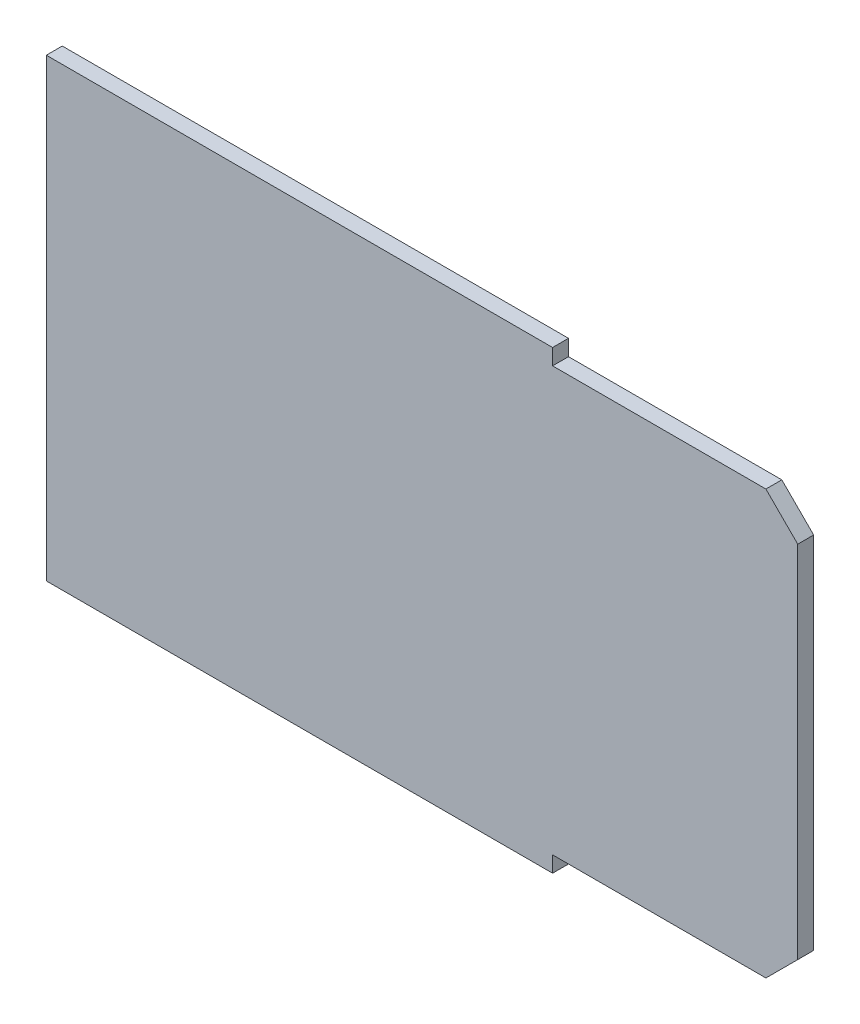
from build123d import *

# Parameters (mm, degrees)
EXTRUSION1_DEPTH = 5
CHANFREIN1_SIZE  = 10


with BuildPart() as part:
    # Esquisse1 → Extrusion1 (new body)
    with BuildSketch(Plane.XY):
        Polygon((159, 5), (159, 0), (0, 0), (0, 143), (159, 143), (159, 138), (236, 138), (236, 5), align=None)
    extrude(amount=EXTRUSION1_DEPTH)

    # Chanfrein1
    chanfrein1_edges = [part.edges().sort_by_distance(p)[0] for p in [
        (236, 138, 2.5),
        (236, 5, 2.5),
    ]]
    chamfer(chanfrein1_edges, length=CHANFREIN1_SIZE)


solid = part.part
